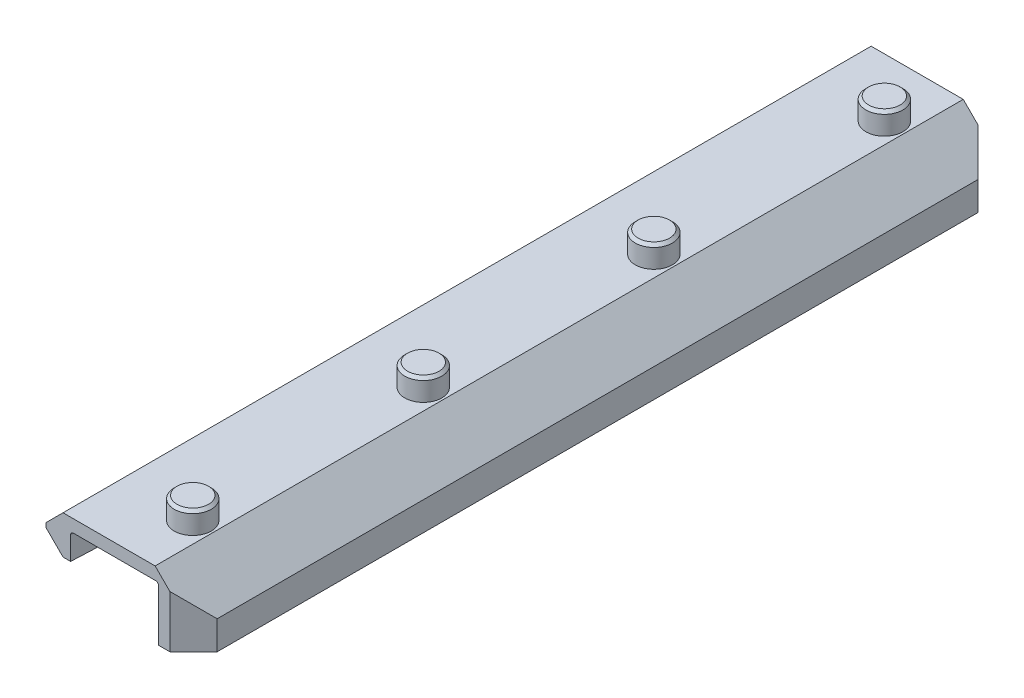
ISO-10303-21;
HEADER;
FILE_DESCRIPTION(('STEP AP214'),'2;1');
FILE_NAME('part.step','',(''),(''),'','','');
FILE_SCHEMA(('AUTOMOTIVE_DESIGN { 1 0 10303 214 1 1 1 1 }'));
ENDSEC;
DATA;
#1=APPLICATION_CONTEXT('core data for automotive mechanical design processes');
#2=APPLICATION_PROTOCOL_DEFINITION('international standard','automotive_design',2000,#1);
#3=PRODUCT_CONTEXT('',#1,'mechanical');
#4=PRODUCT('Part','Part','',(#3));
#5=PRODUCT_RELATED_PRODUCT_CATEGORY('part','',(#4));
#6=PRODUCT_DEFINITION_FORMATION('','',#4);
#7=PRODUCT_DEFINITION_CONTEXT('part definition',#1,'design');
#8=PRODUCT_DEFINITION('design','',#6,#7);
#9=PRODUCT_DEFINITION_SHAPE('','',#8);
#10=(LENGTH_UNIT() NAMED_UNIT(*) SI_UNIT(.MILLI.,.METRE.));
#11=(NAMED_UNIT(*) PLANE_ANGLE_UNIT() SI_UNIT($,.RADIAN.));
#12=(NAMED_UNIT(*) SI_UNIT($,.STERADIAN.) SOLID_ANGLE_UNIT());
#13=UNCERTAINTY_MEASURE_WITH_UNIT(LENGTH_MEASURE(1.E-05),#10,'distance_accuracy_value','');
#14=(GEOMETRIC_REPRESENTATION_CONTEXT(3) GLOBAL_UNCERTAINTY_ASSIGNED_CONTEXT((#13)) GLOBAL_UNIT_ASSIGNED_CONTEXT((#10,
#11,#12)) REPRESENTATION_CONTEXT('',''));
#15=CARTESIAN_POINT('',(0.,0.,0.));
#16=DIRECTION('',(0.,0.,1.));
#17=DIRECTION('',(1.,0.,0.));
#18=AXIS2_PLACEMENT_3D('',#15,#16,#17);
#19=CARTESIAN_POINT('',(-7.62,4.5,108.5342));
#20=DIRECTION('',(0.,-1.,0.));
#21=DIRECTION('',(0.,0.,-1.));
#22=AXIS2_PLACEMENT_3D('',#19,#20,#21);
#23=PLANE('',#22);
#24=CARTESIAN_POINT('',(1.98119999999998,4.5,69.7484));
#25=DIRECTION('',(0.,-1.,0.));
#26=DIRECTION('',(0.,0.,-1.));
#27=AXIS2_PLACEMENT_3D('',#24,#25,#26);
#28=CIRCLE('',#27,2.4892);
#29=CARTESIAN_POINT('',(1.98119999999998,4.5,67.2592));
#30=VERTEX_POINT('',#29);
#31=EDGE_CURVE('E257',#30,#30,#28,.F.);
#32=ORIENTED_EDGE('',*,*,#31,.F.);
#33=EDGE_LOOP('',(#32));
#34=FACE_BOUND('',#33,.T.);
#35=CARTESIAN_POINT('',(1.98119999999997,4.5,7.82319999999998));
#36=DIRECTION('',(0.,-1.,0.));
#37=DIRECTION('',(0.,0.,-1.));
#38=AXIS2_PLACEMENT_3D('',#35,#36,#37);
#39=CIRCLE('',#38,2.4892);
#40=CARTESIAN_POINT('',(1.98119999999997,4.5,5.33399999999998));
#41=VERTEX_POINT('',#40);
#42=EDGE_CURVE('E251',#41,#41,#39,.F.);
#43=ORIENTED_EDGE('',*,*,#42,.F.);
#44=EDGE_LOOP('',(#43));
#45=FACE_BOUND('',#44,.T.);
#46=DIRECTION('',(-1.,0.,0.));
#47=VECTOR('',#46,1.);
#48=CARTESIAN_POINT('',(-7.62,4.5,0.));
#49=LINE('',#48,#47);
#50=CARTESIAN_POINT('',(4.7498,4.5,0.));
#51=VERTEX_POINT('',#50);
#52=CARTESIAN_POINT('',(-7.62,4.5,0.));
#53=VERTEX_POINT('',#52);
#54=EDGE_CURVE('E362',#51,#53,#49,.T.);
#55=ORIENTED_EDGE('',*,*,#54,.T.);
#56=DIRECTION('',(0.,0.,-1.));
#57=VECTOR('',#56,1.);
#58=CARTESIAN_POINT('',(-7.62,4.5,108.5342));
#59=LINE('',#58,#57);
#60=CARTESIAN_POINT('',(-7.62,4.5,108.5342));
#61=VERTEX_POINT('',#60);
#62=EDGE_CURVE('E194',#61,#53,#59,.T.);
#63=ORIENTED_EDGE('',*,*,#62,.F.);
#64=DIRECTION('',(-1.,0.,0.));
#65=VECTOR('',#64,1.);
#66=CARTESIAN_POINT('',(-7.62,4.5,108.5342));
#67=LINE('',#66,#65);
#68=CARTESIAN_POINT('',(4.7498,4.5,108.5342));
#69=VERTEX_POINT('',#68);
#70=EDGE_CURVE('E181',#69,#61,#67,.T.);
#71=ORIENTED_EDGE('',*,*,#70,.F.);
#72=DIRECTION('',(0.,0.,-1.));
#73=VECTOR('',#72,1.);
#74=CARTESIAN_POINT('',(4.7498,4.5,108.5342));
#75=LINE('',#74,#73);
#76=EDGE_CURVE('E192',#69,#51,#75,.T.);
#77=ORIENTED_EDGE('',*,*,#76,.T.);
#78=EDGE_LOOP('',(#55,#63,#71,#77));
#79=FACE_BOUND('',#78,.T.);
#80=CARTESIAN_POINT('',(1.98119999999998,4.5,38.7858));
#81=DIRECTION('',(0.,-1.,0.));
#82=DIRECTION('',(0.,0.,-1.));
#83=AXIS2_PLACEMENT_3D('',#80,#81,#82);
#84=CIRCLE('',#83,2.4892);
#85=CARTESIAN_POINT('',(1.98119999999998,4.5,36.2966));
#86=VERTEX_POINT('',#85);
#87=EDGE_CURVE('E254',#86,#86,#84,.F.);
#88=ORIENTED_EDGE('',*,*,#87,.F.);
#89=EDGE_LOOP('',(#88));
#90=FACE_BOUND('',#89,.T.);
#91=CARTESIAN_POINT('',(1.98119999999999,4.5,100.711));
#92=DIRECTION('',(0.,-1.,0.));
#93=DIRECTION('',(0.,0.,-1.));
#94=AXIS2_PLACEMENT_3D('',#91,#92,#93);
#95=CIRCLE('',#94,2.4892);
#96=CARTESIAN_POINT('',(1.98119999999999,4.5,98.2218));
#97=VERTEX_POINT('',#96);
#98=EDGE_CURVE('E260',#97,#97,#95,.F.);
#99=ORIENTED_EDGE('',*,*,#98,.F.);
#100=EDGE_LOOP('',(#99));
#101=FACE_BOUND('',#100,.T.);
#102=ADVANCED_FACE('F33',(#34,#45,#79,#90,#101),#23,.F.);
#103=CARTESIAN_POINT('',(4.7498,4.5,108.5342));
#104=DIRECTION('',(-0.707106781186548,-0.707106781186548,0.));
#105=DIRECTION('',(0.707106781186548,-0.707106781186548,0.));
#106=AXIS2_PLACEMENT_3D('',#103,#104,#105);
#107=PLANE('',#106);
#108=DIRECTION('',(0.,0.,-1.));
#109=VECTOR('',#108,1.);
#110=CARTESIAN_POINT('',(9.906,-0.656200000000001,108.5342));
#111=LINE('',#110,#109);
#112=CARTESIAN_POINT('',(9.906,-0.656200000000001,105.3592));
#113=VERTEX_POINT('',#112);
#114=CARTESIAN_POINT('',(9.906,-0.656199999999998,3.175));
#115=VERTEX_POINT('',#114);
#116=EDGE_CURVE('E360',#113,#115,#111,.T.);
#117=ORIENTED_EDGE('',*,*,#116,.T.);
#118=DIRECTION('',(0.577350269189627,-0.577350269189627,0.577350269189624));
#119=VECTOR('',#118,1.);
#120=CARTESIAN_POINT('',(9.906,-0.656200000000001,3.17500000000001));
#121=LINE('',#120,#119);
#122=CARTESIAN_POINT('',(6.73099999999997,2.51880000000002,0.));
#123=VERTEX_POINT('',#122);
#124=EDGE_CURVE('E242',#115,#123,#121,.F.);
#125=ORIENTED_EDGE('',*,*,#124,.T.);
#126=DIRECTION('',(-0.707106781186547,0.707106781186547,0.));
#127=VECTOR('',#126,1.);
#128=CARTESIAN_POINT('',(4.7498,4.5,0.));
#129=LINE('',#128,#127);
#130=EDGE_CURVE('E201',#123,#51,#129,.T.);
#131=ORIENTED_EDGE('',*,*,#130,.T.);
#132=ORIENTED_EDGE('',*,*,#76,.F.);
#133=DIRECTION('',(-0.707106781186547,0.707106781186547,0.));
#134=VECTOR('',#133,1.);
#135=CARTESIAN_POINT('',(4.7498,4.5,108.5342));
#136=LINE('',#135,#134);
#137=CARTESIAN_POINT('',(6.73099999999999,2.5188,108.5342));
#138=VERTEX_POINT('',#137);
#139=EDGE_CURVE('E177',#138,#69,#136,.T.);
#140=ORIENTED_EDGE('',*,*,#139,.F.);
#141=DIRECTION('',(0.577350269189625,-0.577350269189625,-0.577350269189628));
#142=VECTOR('',#141,1.);
#143=CARTESIAN_POINT('',(4.00896666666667,5.24083333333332,111.256233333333));
#144=LINE('',#143,#142);
#145=EDGE_CURVE('E240',#138,#113,#144,.T.);
#146=ORIENTED_EDGE('',*,*,#145,.T.);
#147=EDGE_LOOP('',(#117,#125,#131,#132,#140,#146));
#148=FACE_BOUND('',#147,.T.);
#149=ADVANCED_FACE('F199',(#148),#107,.F.);
#150=CARTESIAN_POINT('',(-9.906,2.214,108.5342));
#151=DIRECTION('',(0.707106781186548,-0.707106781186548,0.));
#152=DIRECTION('',(0.707106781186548,0.707106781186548,0.));
#153=AXIS2_PLACEMENT_3D('',#150,#151,#152);
#154=PLANE('',#153);
#155=DIRECTION('',(-0.707106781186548,-0.707106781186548,0.));
#156=VECTOR('',#155,1.);
#157=CARTESIAN_POINT('',(-9.906,2.214,0.));
#158=LINE('',#157,#156);
#159=CARTESIAN_POINT('',(-9.906,2.214,0.));
#160=VERTEX_POINT('',#159);
#161=EDGE_CURVE('E364',#53,#160,#158,.T.);
#162=ORIENTED_EDGE('',*,*,#161,.T.);
#163=DIRECTION('',(0.,0.,-1.));
#164=VECTOR('',#163,1.);
#165=CARTESIAN_POINT('',(-9.906,2.214,108.5342));
#166=LINE('',#165,#164);
#167=CARTESIAN_POINT('',(-9.906,2.214,108.5342));
#168=VERTEX_POINT('',#167);
#169=EDGE_CURVE('E208',#168,#160,#166,.T.);
#170=ORIENTED_EDGE('',*,*,#169,.F.);
#171=DIRECTION('',(-0.707106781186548,-0.707106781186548,0.));
#172=VECTOR('',#171,1.);
#173=CARTESIAN_POINT('',(-9.906,2.214,108.5342));
#174=LINE('',#173,#172);
#175=EDGE_CURVE('E196',#61,#168,#174,.T.);
#176=ORIENTED_EDGE('',*,*,#175,.F.);
#177=ORIENTED_EDGE('',*,*,#62,.T.);
#178=EDGE_LOOP('',(#162,#170,#176,#177));
#179=FACE_BOUND('',#178,.T.);
#180=ADVANCED_FACE('F433',(#179),#154,.F.);
#181=CARTESIAN_POINT('',(-9.906,1.6298,108.5342));
#182=DIRECTION('',(1.,0.,0.));
#183=DIRECTION('',(0.,0.,-1.));
#184=AXIS2_PLACEMENT_3D('',#181,#182,#183);
#185=PLANE('',#184);
#186=DIRECTION('',(0.,-1.,0.));
#187=VECTOR('',#186,1.);
#188=CARTESIAN_POINT('',(-9.906,1.6298,0.));
#189=LINE('',#188,#187);
#190=CARTESIAN_POINT('',(-9.906,1.6298,0.));
#191=VERTEX_POINT('',#190);
#192=EDGE_CURVE('E366',#160,#191,#189,.T.);
#193=ORIENTED_EDGE('',*,*,#192,.T.);
#194=DIRECTION('',(0.,0.,-1.));
#195=VECTOR('',#194,1.);
#196=CARTESIAN_POINT('',(-9.906,1.6298,108.5342));
#197=LINE('',#196,#195);
#198=CARTESIAN_POINT('',(-9.906,1.6298,108.5342));
#199=VERTEX_POINT('',#198);
#200=EDGE_CURVE('E390',#199,#191,#197,.T.);
#201=ORIENTED_EDGE('',*,*,#200,.F.);
#202=DIRECTION('',(0.,-1.,0.));
#203=VECTOR('',#202,1.);
#204=CARTESIAN_POINT('',(-9.906,1.6298,108.5342));
#205=LINE('',#204,#203);
#206=EDGE_CURVE('E355',#168,#199,#205,.T.);
#207=ORIENTED_EDGE('',*,*,#206,.F.);
#208=ORIENTED_EDGE('',*,*,#169,.T.);
#209=EDGE_LOOP('',(#193,#201,#207,#208));
#210=FACE_BOUND('',#209,.T.);
#211=ADVANCED_FACE('F397',(#210),#185,.F.);
#212=CARTESIAN_POINT('',(-7.62,-0.656200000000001,108.5342));
#213=DIRECTION('',(0.707106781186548,0.707106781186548,0.));
#214=DIRECTION('',(-0.707106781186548,0.707106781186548,0.));
#215=AXIS2_PLACEMENT_3D('',#212,#213,#214);
#216=PLANE('',#215);
#217=DIRECTION('',(0.707106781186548,-0.707106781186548,0.));
#218=VECTOR('',#217,1.);
#219=CARTESIAN_POINT('',(-7.62,-0.656200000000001,0.));
#220=LINE('',#219,#218);
#221=CARTESIAN_POINT('',(-7.62,-0.656200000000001,0.));
#222=VERTEX_POINT('',#221);
#223=EDGE_CURVE('E368',#191,#222,#220,.T.);
#224=ORIENTED_EDGE('',*,*,#223,.T.);
#225=DIRECTION('',(0.,0.,-1.));
#226=VECTOR('',#225,1.);
#227=CARTESIAN_POINT('',(-7.62,-0.656200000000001,108.5342));
#228=LINE('',#227,#226);
#229=CARTESIAN_POINT('',(-7.62,-0.656200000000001,108.5342));
#230=VERTEX_POINT('',#229);
#231=EDGE_CURVE('E388',#230,#222,#228,.T.);
#232=ORIENTED_EDGE('',*,*,#231,.F.);
#233=DIRECTION('',(0.707106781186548,-0.707106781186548,0.));
#234=VECTOR('',#233,1.);
#235=CARTESIAN_POINT('',(-7.62,-0.656200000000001,108.5342));
#236=LINE('',#235,#234);
#237=EDGE_CURVE('E347',#199,#230,#236,.T.);
#238=ORIENTED_EDGE('',*,*,#237,.F.);
#239=ORIENTED_EDGE('',*,*,#200,.T.);
#240=EDGE_LOOP('',(#224,#232,#238,#239));
#241=FACE_BOUND('',#240,.T.);
#242=ADVANCED_FACE('F406',(#241),#216,.F.);
#243=CARTESIAN_POINT('',(-6.096,-0.656200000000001,108.5342));
#244=DIRECTION('',(0.,1.,0.));
#245=DIRECTION('',(-1.,0.,0.));
#246=AXIS2_PLACEMENT_3D('',#243,#244,#245);
#247=PLANE('',#246);
#248=DIRECTION('',(1.,0.,0.));
#249=VECTOR('',#248,1.);
#250=CARTESIAN_POINT('',(-6.096,-0.656200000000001,0.));
#251=LINE('',#250,#249);
#252=CARTESIAN_POINT('',(-6.604,-0.656200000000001,0.));
#253=VERTEX_POINT('',#252);
#254=EDGE_CURVE('E370',#222,#253,#251,.T.);
#255=ORIENTED_EDGE('',*,*,#254,.T.);
#256=DIRECTION('',(-0.0457187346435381,0.,-0.998954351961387));
#257=VECTOR('',#256,1.);
#258=CARTESIAN_POINT('',(-6.096,-0.656200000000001,11.0998000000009));
#259=LINE('',#258,#257);
#260=CARTESIAN_POINT('',(-6.09599999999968,-0.656200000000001,11.0998000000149));
#261=VERTEX_POINT('',#260);
#262=EDGE_CURVE('E233',#253,#261,#259,.F.);
#263=ORIENTED_EDGE('',*,*,#262,.T.);
#264=DIRECTION('',(0.,0.,-1.));
#265=VECTOR('',#264,1.);
#266=CARTESIAN_POINT('',(-6.096,-0.656200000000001,108.5342));
#267=LINE('',#266,#265);
#268=CARTESIAN_POINT('',(-6.096,-0.656200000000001,97.4343999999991));
#269=VERTEX_POINT('',#268);
#270=EDGE_CURVE('E385',#269,#261,#267,.T.);
#271=ORIENTED_EDGE('',*,*,#270,.F.);
#272=DIRECTION('',(-0.0457187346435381,0.,0.998954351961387));
#273=VECTOR('',#272,1.);
#274=CARTESIAN_POINT('',(-6.604,-0.656200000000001,108.5342));
#275=LINE('',#274,#273);
#276=CARTESIAN_POINT('',(-6.604,-0.656200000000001,108.5342));
#277=VERTEX_POINT('',#276);
#278=EDGE_CURVE('E219',#269,#277,#275,.T.);
#279=ORIENTED_EDGE('',*,*,#278,.T.);
#280=DIRECTION('',(1.,0.,0.));
#281=VECTOR('',#280,1.);
#282=CARTESIAN_POINT('',(-6.096,-0.656200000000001,108.5342));
#283=LINE('',#282,#281);
#284=EDGE_CURVE('E345',#230,#277,#283,.T.);
#285=ORIENTED_EDGE('',*,*,#284,.F.);
#286=ORIENTED_EDGE('',*,*,#231,.T.);
#287=EDGE_LOOP('',(#255,#263,#271,#279,#285,#286));
#288=FACE_BOUND('',#287,.T.);
#289=ADVANCED_FACE('F407',(#288),#247,.F.);
#290=CARTESIAN_POINT('',(-6.096,2.8236,108.5342));
#291=DIRECTION('',(-1.,0.,0.));
#292=DIRECTION('',(0.,-1.,0.));
#293=AXIS2_PLACEMENT_3D('',#290,#291,#292);
#294=PLANE('',#293);
#295=DIRECTION('',(0.,1.,0.));
#296=VECTOR('',#295,1.);
#297=CARTESIAN_POINT('',(-6.096,2.8236,11.0998000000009));
#298=LINE('',#297,#296);
#299=CARTESIAN_POINT('',(-6.096,2.4426,11.0998000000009));
#300=VERTEX_POINT('',#299);
#301=EDGE_CURVE('E230',#261,#300,#298,.T.);
#302=ORIENTED_EDGE('',*,*,#301,.T.);
#303=DIRECTION('',(0.,0.,-1.));
#304=VECTOR('',#303,1.);
#305=CARTESIAN_POINT('',(-6.096,2.4426,97.4343999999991));
#306=LINE('',#305,#304);
#307=CARTESIAN_POINT('',(-6.096,2.4426,97.4343999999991));
#308=VERTEX_POINT('',#307);
#309=EDGE_CURVE('E310',#300,#308,#306,.F.);
#310=ORIENTED_EDGE('',*,*,#309,.T.);
#311=DIRECTION('',(0.,-1.,0.));
#312=VECTOR('',#311,1.);
#313=CARTESIAN_POINT('',(-6.096,-0.656200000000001,97.4343999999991));
#314=LINE('',#313,#312);
#315=EDGE_CURVE('E217',#308,#269,#314,.T.);
#316=ORIENTED_EDGE('',*,*,#315,.T.);
#317=ORIENTED_EDGE('',*,*,#270,.T.);
#318=EDGE_LOOP('',(#302,#310,#316,#317));
#319=FACE_BOUND('',#318,.T.);
#320=ADVANCED_FACE('F415',(#319),#294,.F.);
#321=CARTESIAN_POINT('',(4.699,2.8236,108.5342));
#322=DIRECTION('',(0.,1.,0.));
#323=DIRECTION('',(-1.,0.,0.));
#324=AXIS2_PLACEMENT_3D('',#321,#322,#323);
#325=PLANE('',#324);
#326=DIRECTION('',(1.,0.,0.));
#327=VECTOR('',#326,1.);
#328=CARTESIAN_POINT('',(4.699,2.8236,0.));
#329=LINE('',#328,#327);
#330=CARTESIAN_POINT('',(-6.22260119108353,2.8236,0.));
#331=VERTEX_POINT('',#330);
#332=CARTESIAN_POINT('',(4.82560119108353,2.8236,0.));
#333=VERTEX_POINT('',#332);
#334=EDGE_CURVE('E373',#331,#333,#329,.T.);
#335=ORIENTED_EDGE('',*,*,#334,.T.);
#336=DIRECTION('',(0.0457187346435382,0.,-0.998954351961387));
#337=VECTOR('',#336,1.);
#338=CARTESIAN_POINT('',(-0.131521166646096,2.8236,108.313123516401));
#339=LINE('',#338,#337);
#340=CARTESIAN_POINT('',(4.318,2.8236,11.0910860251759));
#341=VERTEX_POINT('',#340);
#342=EDGE_CURVE('E298',#333,#341,#339,.F.);
#343=ORIENTED_EDGE('',*,*,#342,.T.);
#344=DIRECTION('',(0.,0.,-1.));
#345=VECTOR('',#344,1.);
#346=CARTESIAN_POINT('',(4.318,2.8236,97.4343999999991));
#347=LINE('',#346,#345);
#348=CARTESIAN_POINT('',(4.318,2.8236,97.4431139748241));
#349=VERTEX_POINT('',#348);
#350=EDGE_CURVE('E294',#341,#349,#347,.F.);
#351=ORIENTED_EDGE('',*,*,#350,.T.);
#352=DIRECTION('',(0.0457187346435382,0.,0.998954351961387));
#353=VECTOR('',#352,1.);
#354=CARTESIAN_POINT('',(4.82533656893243,2.8236,108.528418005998));
#355=LINE('',#354,#353);
#356=CARTESIAN_POINT('',(4.82560119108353,2.8236,108.5342));
#357=VERTEX_POINT('',#356);
#358=EDGE_CURVE('E296',#349,#357,#355,.T.);
#359=ORIENTED_EDGE('',*,*,#358,.T.);
#360=DIRECTION('',(1.,0.,0.));
#361=VECTOR('',#360,1.);
#362=CARTESIAN_POINT('',(4.699,2.8236,108.5342));
#363=LINE('',#362,#361);
#364=CARTESIAN_POINT('',(-6.22260119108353,2.8236,108.5342));
#365=VERTEX_POINT('',#364);
#366=EDGE_CURVE('E351',#365,#357,#363,.T.);
#367=ORIENTED_EDGE('',*,*,#366,.F.);
#368=DIRECTION('',(0.0457187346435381,0.,-0.998954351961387));
#369=VECTOR('',#368,1.);
#370=CARTESIAN_POINT('',(-6.19977283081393,2.8236,108.035400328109));
#371=LINE('',#370,#369);
#372=CARTESIAN_POINT('',(-5.715,2.8236,97.4431139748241));
#373=VERTEX_POINT('',#372);
#374=EDGE_CURVE('E289',#365,#373,#371,.T.);
#375=ORIENTED_EDGE('',*,*,#374,.T.);
#376=DIRECTION('',(0.,0.,-1.));
#377=VECTOR('',#376,1.);
#378=CARTESIAN_POINT('',(-5.715,2.8236,11.0998000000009));
#379=LINE('',#378,#377);
#380=CARTESIAN_POINT('',(-5.715,2.8236,11.0910860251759));
#381=VERTEX_POINT('',#380);
#382=EDGE_CURVE('E287',#373,#381,#379,.T.);
#383=ORIENTED_EDGE('',*,*,#382,.T.);
#384=DIRECTION('',(0.0457187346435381,0.,0.998954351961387));
#385=VECTOR('',#384,1.);
#386=CARTESIAN_POINT('',(-1.24291509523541,2.8236,108.80614119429));
#387=LINE('',#386,#385);
#388=EDGE_CURVE('E291',#381,#331,#387,.F.);
#389=ORIENTED_EDGE('',*,*,#388,.T.);
#390=EDGE_LOOP('',(#335,#343,#351,#359,#367,#375,#383,#389));
#391=FACE_BOUND('',#390,.T.);
#392=ADVANCED_FACE('F417',(#391),#325,.F.);
#393=CARTESIAN_POINT('',(4.699,-4.5,108.5342));
#394=DIRECTION('',(1.,0.,0.));
#395=DIRECTION('',(0.,1.,0.));
#396=AXIS2_PLACEMENT_3D('',#393,#394,#395);
#397=PLANE('',#396);
#398=DIRECTION('',(0.,1.,0.));
#399=VECTOR('',#398,1.);
#400=CARTESIAN_POINT('',(4.699,2.8236,97.4343999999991));
#401=LINE('',#400,#399);
#402=CARTESIAN_POINT('',(4.699,-4.5,97.4343999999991));
#403=VERTEX_POINT('',#402);
#404=CARTESIAN_POINT('',(4.699,2.4426,97.4343999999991));
#405=VERTEX_POINT('',#404);
#406=EDGE_CURVE('E215',#403,#405,#401,.T.);
#407=ORIENTED_EDGE('',*,*,#406,.T.);
#408=DIRECTION('',(0.,0.,-1.));
#409=VECTOR('',#408,1.);
#410=CARTESIAN_POINT('',(4.699,2.4426,11.0998000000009));
#411=LINE('',#410,#409);
#412=CARTESIAN_POINT('',(4.699,2.4426,11.0998000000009));
#413=VERTEX_POINT('',#412);
#414=EDGE_CURVE('E308',#405,#413,#411,.T.);
#415=ORIENTED_EDGE('',*,*,#414,.T.);
#416=DIRECTION('',(0.,-1.,0.));
#417=VECTOR('',#416,1.);
#418=CARTESIAN_POINT('',(4.699,-4.5,11.0998000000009));
#419=LINE('',#418,#417);
#420=CARTESIAN_POINT('',(4.69899999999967,-4.5,11.0998000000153));
#421=VERTEX_POINT('',#420);
#422=EDGE_CURVE('E221',#413,#421,#419,.T.);
#423=ORIENTED_EDGE('',*,*,#422,.T.);
#424=DIRECTION('',(0.,0.,-1.));
#425=VECTOR('',#424,1.);
#426=CARTESIAN_POINT('',(4.699,-4.5,108.5342));
#427=LINE('',#426,#425);
#428=EDGE_CURVE('E382',#403,#421,#427,.T.);
#429=ORIENTED_EDGE('',*,*,#428,.F.);
#430=EDGE_LOOP('',(#407,#415,#423,#429));
#431=FACE_BOUND('',#430,.T.);
#432=ADVANCED_FACE('F423',(#431),#397,.F.);
#433=CARTESIAN_POINT('',(9.906,-4.5,108.5342));
#434=DIRECTION('',(0.,1.,0.));
#435=DIRECTION('',(0.,0.,1.));
#436=AXIS2_PLACEMENT_3D('',#433,#434,#435);
#437=PLANE('',#436);
#438=DIRECTION('',(1.,0.,0.));
#439=VECTOR('',#438,1.);
#440=CARTESIAN_POINT('',(9.906,-4.5,0.));
#441=LINE('',#440,#439);
#442=CARTESIAN_POINT('',(5.207,-4.5,0.));
#443=VERTEX_POINT('',#442);
#444=CARTESIAN_POINT('',(6.73099999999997,-4.5,0.));
#445=VERTEX_POINT('',#444);
#446=EDGE_CURVE('E187',#443,#445,#441,.T.);
#447=ORIENTED_EDGE('',*,*,#446,.T.);
#448=DIRECTION('',(-0.707106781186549,0.,-0.707106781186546));
#449=VECTOR('',#448,1.);
#450=CARTESIAN_POINT('',(9.906,-4.5,3.17500000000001));
#451=LINE('',#450,#449);
#452=CARTESIAN_POINT('',(9.906,-4.5,3.17500000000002));
#453=VERTEX_POINT('',#452);
#454=EDGE_CURVE('E248',#445,#453,#451,.F.);
#455=ORIENTED_EDGE('',*,*,#454,.T.);
#456=DIRECTION('',(0.,0.,-1.));
#457=VECTOR('',#456,1.);
#458=CARTESIAN_POINT('',(9.906,-4.5,108.5342));
#459=LINE('',#458,#457);
#460=CARTESIAN_POINT('',(9.906,-4.5,105.3592));
#461=VERTEX_POINT('',#460);
#462=EDGE_CURVE('E379',#461,#453,#459,.T.);
#463=ORIENTED_EDGE('',*,*,#462,.F.);
#464=DIRECTION('',(-0.707106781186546,0.,0.707106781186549));
#465=VECTOR('',#464,1.);
#466=CARTESIAN_POINT('',(6.731,-4.5,108.5342));
#467=LINE('',#466,#465);
#468=CARTESIAN_POINT('',(6.731,-4.5,108.5342));
#469=VERTEX_POINT('',#468);
#470=EDGE_CURVE('E246',#461,#469,#467,.T.);
#471=ORIENTED_EDGE('',*,*,#470,.T.);
#472=DIRECTION('',(1.,0.,0.));
#473=VECTOR('',#472,1.);
#474=CARTESIAN_POINT('',(9.906,-4.5,108.5342));
#475=LINE('',#474,#473);
#476=CARTESIAN_POINT('',(5.207,-4.5,108.5342));
#477=VERTEX_POINT('',#476);
#478=EDGE_CURVE('E353',#477,#469,#475,.T.);
#479=ORIENTED_EDGE('',*,*,#478,.F.);
#480=DIRECTION('',(-0.0457187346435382,0.,-0.998954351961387));
#481=VECTOR('',#480,1.);
#482=CARTESIAN_POINT('',(5.207,-4.5,108.5342));
#483=LINE('',#482,#481);
#484=EDGE_CURVE('E213',#477,#403,#483,.T.);
#485=ORIENTED_EDGE('',*,*,#484,.T.);
#486=ORIENTED_EDGE('',*,*,#428,.T.);
#487=DIRECTION('',(-0.0457187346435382,0.,0.998954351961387));
#488=VECTOR('',#487,1.);
#489=CARTESIAN_POINT('',(4.699,-4.5,11.0998000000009));
#490=LINE('',#489,#488);
#491=EDGE_CURVE('E223',#421,#443,#490,.F.);
#492=ORIENTED_EDGE('',*,*,#491,.T.);
#493=EDGE_LOOP('',(#447,#455,#463,#471,#479,#485,#486,#492));
#494=FACE_BOUND('',#493,.T.);
#495=ADVANCED_FACE('F631',(#494),#437,.F.);
#496=CARTESIAN_POINT('',(9.906,-0.656200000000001,108.5342));
#497=DIRECTION('',(-1.,0.,0.));
#498=DIRECTION('',(0.,0.,1.));
#499=AXIS2_PLACEMENT_3D('',#496,#497,#498);
#500=PLANE('',#499);
#501=ORIENTED_EDGE('',*,*,#462,.T.);
#502=DIRECTION('',(0.,1.,0.));
#503=VECTOR('',#502,1.);
#504=CARTESIAN_POINT('',(9.906,-0.656200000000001,3.17500000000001));
#505=LINE('',#504,#503);
#506=EDGE_CURVE('E237',#453,#115,#505,.T.);
#507=ORIENTED_EDGE('',*,*,#506,.T.);
#508=ORIENTED_EDGE('',*,*,#116,.F.);
#509=DIRECTION('',(0.,-1.,0.));
#510=VECTOR('',#509,1.);
#511=CARTESIAN_POINT('',(9.906,-4.5,105.3592));
#512=LINE('',#511,#510);
#513=EDGE_CURVE('E235',#113,#461,#512,.T.);
#514=ORIENTED_EDGE('',*,*,#513,.T.);
#515=EDGE_LOOP('',(#501,#507,#508,#514));
#516=FACE_BOUND('',#515,.T.);
#517=ADVANCED_FACE('F624',(#516),#500,.F.);
#518=CARTESIAN_POINT('',(-1.4351,10.6849,108.5342));
#519=DIRECTION('',(0.,0.,1.));
#520=DIRECTION('',(1.,0.,0.));
#521=AXIS2_PLACEMENT_3D('',#518,#519,#520);
#522=PLANE('',#521);
#523=ORIENTED_EDGE('',*,*,#478,.T.);
#524=DIRECTION('',(0.,1.,0.));
#525=VECTOR('',#524,1.);
#526=CARTESIAN_POINT('',(6.731,-0.656200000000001,108.5342));
#527=LINE('',#526,#525);
#528=EDGE_CURVE('E184',#469,#138,#527,.T.);
#529=ORIENTED_EDGE('',*,*,#528,.T.);
#530=ORIENTED_EDGE('',*,*,#139,.T.);
#531=ORIENTED_EDGE('',*,*,#70,.T.);
#532=ORIENTED_EDGE('',*,*,#175,.T.);
#533=ORIENTED_EDGE('',*,*,#206,.T.);
#534=ORIENTED_EDGE('',*,*,#237,.T.);
#535=ORIENTED_EDGE('',*,*,#284,.T.);
#536=DIRECTION('',(0.,1.,0.));
#537=VECTOR('',#536,1.);
#538=CARTESIAN_POINT('',(-6.604,2.8236,108.5342));
#539=LINE('',#538,#537);
#540=CARTESIAN_POINT('',(-6.604,2.4426,108.5342));
#541=VERTEX_POINT('',#540);
#542=EDGE_CURVE('E203',#277,#541,#539,.T.);
#543=ORIENTED_EDGE('',*,*,#542,.T.);
#544=CARTESIAN_POINT('',(-6.22260119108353,2.4426,108.5342));
#545=DIRECTION('',(0.,0.,1.));
#546=DIRECTION('',(1.,0.,0.));
#547=AXIS2_PLACEMENT_3D('',#544,#545,#546);
#548=ELLIPSE('',#547,0.381398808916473,0.381);
#549=EDGE_CURVE('E42',#541,#365,#548,.F.);
#550=ORIENTED_EDGE('',*,*,#549,.T.);
#551=ORIENTED_EDGE('',*,*,#366,.T.);
#552=CARTESIAN_POINT('',(4.82560119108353,2.4426,108.5342));
#553=DIRECTION('',(0.,0.,1.));
#554=DIRECTION('',(1.,0.,0.));
#555=AXIS2_PLACEMENT_3D('',#552,#553,#554);
#556=ELLIPSE('',#555,0.381398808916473,0.381);
#557=CARTESIAN_POINT('',(5.207,2.4426,108.5342));
#558=VERTEX_POINT('',#557);
#559=EDGE_CURVE('E11',#357,#558,#556,.F.);
#560=ORIENTED_EDGE('',*,*,#559,.T.);
#561=DIRECTION('',(0.,-1.,0.));
#562=VECTOR('',#561,1.);
#563=CARTESIAN_POINT('',(5.207,-4.5,108.5342));
#564=LINE('',#563,#562);
#565=EDGE_CURVE('E206',#558,#477,#564,.T.);
#566=ORIENTED_EDGE('',*,*,#565,.T.);
#567=EDGE_LOOP('',(#523,#529,#530,#531,#532,#533,#534,#535,#543,#550,#551,#560,#566));
#568=FACE_BOUND('',#567,.T.);
#569=ADVANCED_FACE('F180',(#568),#522,.T.);
#570=CARTESIAN_POINT('',(-1.4351,10.6849,0.));
#571=DIRECTION('',(0.,0.,1.));
#572=DIRECTION('',(1.,0.,0.));
#573=AXIS2_PLACEMENT_3D('',#570,#571,#572);
#574=PLANE('',#573);
#575=ORIENTED_EDGE('',*,*,#130,.F.);
#576=DIRECTION('',(0.,-1.,0.));
#577=VECTOR('',#576,1.);
#578=CARTESIAN_POINT('',(6.73099999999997,10.6849,0.));
#579=LINE('',#578,#577);
#580=EDGE_CURVE('E244',#123,#445,#579,.T.);
#581=ORIENTED_EDGE('',*,*,#580,.T.);
#582=ORIENTED_EDGE('',*,*,#446,.F.);
#583=DIRECTION('',(0.,1.,0.));
#584=VECTOR('',#583,1.);
#585=CARTESIAN_POINT('',(5.207,10.6849,0.));
#586=LINE('',#585,#584);
#587=CARTESIAN_POINT('',(5.207,2.4426,0.));
#588=VERTEX_POINT('',#587);
#589=EDGE_CURVE('E227',#443,#588,#586,.T.);
#590=ORIENTED_EDGE('',*,*,#589,.T.);
#591=CARTESIAN_POINT('',(4.82560119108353,2.4426,0.));
#592=DIRECTION('',(0.,0.,1.));
#593=DIRECTION('',(1.,0.,0.));
#594=AXIS2_PLACEMENT_3D('',#591,#592,#593);
#595=ELLIPSE('',#594,0.381398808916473,0.381);
#596=EDGE_CURVE('E312',#588,#333,#595,.T.);
#597=ORIENTED_EDGE('',*,*,#596,.T.);
#598=ORIENTED_EDGE('',*,*,#334,.F.);
#599=CARTESIAN_POINT('',(-6.22260119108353,2.4426,0.));
#600=DIRECTION('',(0.,0.,1.));
#601=DIRECTION('',(1.,0.,0.));
#602=AXIS2_PLACEMENT_3D('',#599,#600,#601);
#603=ELLIPSE('',#602,0.381398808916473,0.381);
#604=CARTESIAN_POINT('',(-6.604,2.4426,0.));
#605=VERTEX_POINT('',#604);
#606=EDGE_CURVE('E314',#331,#605,#603,.T.);
#607=ORIENTED_EDGE('',*,*,#606,.T.);
#608=DIRECTION('',(0.,-1.,0.));
#609=VECTOR('',#608,1.);
#610=CARTESIAN_POINT('',(-6.604,10.6849,0.));
#611=LINE('',#610,#609);
#612=EDGE_CURVE('E225',#605,#253,#611,.T.);
#613=ORIENTED_EDGE('',*,*,#612,.T.);
#614=ORIENTED_EDGE('',*,*,#254,.F.);
#615=ORIENTED_EDGE('',*,*,#223,.F.);
#616=ORIENTED_EDGE('',*,*,#192,.F.);
#617=ORIENTED_EDGE('',*,*,#161,.F.);
#618=ORIENTED_EDGE('',*,*,#54,.F.);
#619=EDGE_LOOP('',(#575,#581,#582,#590,#597,#598,#607,#613,#614,#615,#616,#617,#618));
#620=FACE_BOUND('',#619,.T.);
#621=ADVANCED_FACE('F403',(#620),#574,.F.);
#622=CARTESIAN_POINT('',(5.207,10.6849,108.5342));
#623=DIRECTION('',(-0.998954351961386,0.,0.0457187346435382));
#624=DIRECTION('',(0.0457187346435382,0.,0.998954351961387));
#625=AXIS2_PLACEMENT_3D('',#622,#623,#624);
#626=PLANE('',#625);
#627=ORIENTED_EDGE('',*,*,#565,.F.);
#628=DIRECTION('',(0.0457187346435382,0.,0.998954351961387));
#629=VECTOR('',#628,1.);
#630=CARTESIAN_POINT('',(5.207,2.4426,108.5342));
#631=LINE('',#630,#629);
#632=EDGE_CURVE('E55',#558,#405,#631,.F.);
#633=ORIENTED_EDGE('',*,*,#632,.T.);
#634=ORIENTED_EDGE('',*,*,#406,.F.);
#635=ORIENTED_EDGE('',*,*,#484,.F.);
#636=EDGE_LOOP('',(#627,#633,#634,#635));
#637=FACE_BOUND('',#636,.T.);
#638=ADVANCED_FACE('F440',(#637),#626,.T.);
#639=CARTESIAN_POINT('',(-6.604,10.6849,108.5342));
#640=DIRECTION('',(0.998954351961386,0.,0.0457187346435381));
#641=DIRECTION('',(0.0457187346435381,0.,-0.998954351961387));
#642=AXIS2_PLACEMENT_3D('',#639,#640,#641);
#643=PLANE('',#642);
#644=ORIENTED_EDGE('',*,*,#315,.F.);
#645=DIRECTION('',(0.0457187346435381,0.,-0.998954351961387));
#646=VECTOR('',#645,1.);
#647=CARTESIAN_POINT('',(-6.604,2.4426,108.5342));
#648=LINE('',#647,#646);
#649=EDGE_CURVE('E305',#308,#541,#648,.F.);
#650=ORIENTED_EDGE('',*,*,#649,.T.);
#651=ORIENTED_EDGE('',*,*,#542,.F.);
#652=ORIENTED_EDGE('',*,*,#278,.F.);
#653=EDGE_LOOP('',(#644,#650,#651,#652));
#654=FACE_BOUND('',#653,.T.);
#655=ADVANCED_FACE('F340',(#654),#643,.T.);
#656=CARTESIAN_POINT('',(4.699,-4.5,11.0998000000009));
#657=DIRECTION('',(0.998954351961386,0.,0.0457187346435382));
#658=DIRECTION('',(0.0457187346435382,0.,-0.998954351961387));
#659=AXIS2_PLACEMENT_3D('',#656,#657,#658);
#660=PLANE('',#659);
#661=ORIENTED_EDGE('',*,*,#422,.F.);
#662=DIRECTION('',(-0.0457187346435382,0.,0.998954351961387));
#663=VECTOR('',#662,1.);
#664=CARTESIAN_POINT('',(4.699,2.4426,11.0998000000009));
#665=LINE('',#664,#663);
#666=EDGE_CURVE('E301',#413,#588,#665,.F.);
#667=ORIENTED_EDGE('',*,*,#666,.T.);
#668=ORIENTED_EDGE('',*,*,#589,.F.);
#669=ORIENTED_EDGE('',*,*,#491,.F.);
#670=EDGE_LOOP('',(#661,#667,#668,#669));
#671=FACE_BOUND('',#670,.T.);
#672=ADVANCED_FACE('F445',(#671),#660,.F.);
#673=CARTESIAN_POINT('',(-6.096,2.8236,11.0998000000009));
#674=DIRECTION('',(-0.998954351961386,0.,0.0457187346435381));
#675=DIRECTION('',(0.0457187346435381,0.,0.998954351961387));
#676=AXIS2_PLACEMENT_3D('',#673,#674,#675);
#677=PLANE('',#676);
#678=ORIENTED_EDGE('',*,*,#612,.F.);
#679=DIRECTION('',(-0.0457187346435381,0.,-0.998954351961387));
#680=VECTOR('',#679,1.);
#681=CARTESIAN_POINT('',(-6.096,2.4426,11.0998000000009));
#682=LINE('',#681,#680);
#683=EDGE_CURVE('E303',#605,#300,#682,.F.);
#684=ORIENTED_EDGE('',*,*,#683,.T.);
#685=ORIENTED_EDGE('',*,*,#301,.F.);
#686=ORIENTED_EDGE('',*,*,#262,.F.);
#687=EDGE_LOOP('',(#678,#684,#685,#686));
#688=FACE_BOUND('',#687,.T.);
#689=ADVANCED_FACE('F413',(#688),#677,.F.);
#690=CARTESIAN_POINT('',(9.906,-0.656200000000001,3.17500000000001));
#691=DIRECTION('',(-0.707106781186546,0.,0.707106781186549));
#692=DIRECTION('',(0.707106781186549,0.,0.707106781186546));
#693=AXIS2_PLACEMENT_3D('',#690,#691,#692);
#694=PLANE('',#693);
#695=ORIENTED_EDGE('',*,*,#454,.F.);
#696=ORIENTED_EDGE('',*,*,#580,.F.);
#697=ORIENTED_EDGE('',*,*,#124,.F.);
#698=ORIENTED_EDGE('',*,*,#506,.F.);
#699=EDGE_LOOP('',(#695,#696,#697,#698));
#700=FACE_BOUND('',#699,.T.);
#701=ADVANCED_FACE('F451',(#700),#694,.F.);
#702=CARTESIAN_POINT('',(6.731,10.6849,108.5342));
#703=DIRECTION('',(0.707106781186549,0.,0.707106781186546));
#704=DIRECTION('',(0.707106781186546,0.,-0.707106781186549));
#705=AXIS2_PLACEMENT_3D('',#702,#703,#704);
#706=PLANE('',#705);
#707=ORIENTED_EDGE('',*,*,#470,.F.);
#708=ORIENTED_EDGE('',*,*,#513,.F.);
#709=ORIENTED_EDGE('',*,*,#145,.F.);
#710=ORIENTED_EDGE('',*,*,#528,.F.);
#711=EDGE_LOOP('',(#707,#708,#709,#710));
#712=FACE_BOUND('',#711,.T.);
#713=ADVANCED_FACE('F454',(#712),#706,.T.);
#714=CARTESIAN_POINT('',(1.98119999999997,7.421,7.82319999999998));
#715=DIRECTION('',(0.,-1.,0.));
#716=DIRECTION('',(0.,0.,-1.));
#717=AXIS2_PLACEMENT_3D('',#714,#715,#716);
#718=CYLINDRICAL_SURFACE('',#717,2.4892);
#719=CARTESIAN_POINT('',(1.98119999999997,7.04,7.82319999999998));
#720=DIRECTION('',(0.,1.,0.));
#721=DIRECTION('',(0.,0.,1.));
#722=AXIS2_PLACEMENT_3D('',#719,#720,#721);
#723=CIRCLE('',#722,2.4892);
#724=CARTESIAN_POINT('',(1.98119999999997,7.04,10.3124));
#725=VERTEX_POINT('',#724);
#726=EDGE_CURVE('E284',#725,#725,#723,.F.);
#727=ORIENTED_EDGE('',*,*,#726,.T.);
#728=EDGE_LOOP('',(#727));
#729=FACE_BOUND('',#728,.T.);
#730=ORIENTED_EDGE('',*,*,#42,.T.);
#731=EDGE_LOOP('',(#730));
#732=FACE_BOUND('',#731,.T.);
#733=ADVANCED_FACE('F458',(#729,#732),#718,.T.);
#734=CARTESIAN_POINT('',(1.98119999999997,7.421,7.82319999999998));
#735=DIRECTION('',(0.,1.,0.));
#736=DIRECTION('',(0.,0.,1.));
#737=AXIS2_PLACEMENT_3D('',#734,#735,#736);
#738=PLANE('',#737);
#739=CARTESIAN_POINT('',(1.98119999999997,7.421,7.82319999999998));
#740=DIRECTION('',(0.,1.,0.));
#741=DIRECTION('',(0.,0.,1.));
#742=AXIS2_PLACEMENT_3D('',#739,#740,#741);
#743=CIRCLE('',#742,2.1082);
#744=CARTESIAN_POINT('',(1.98119999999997,7.421,9.93139999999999));
#745=VERTEX_POINT('',#744);
#746=EDGE_CURVE('E281',#745,#745,#743,.T.);
#747=ORIENTED_EDGE('',*,*,#746,.T.);
#748=EDGE_LOOP('',(#747));
#749=FACE_BOUND('',#748,.T.);
#750=ADVANCED_FACE('F572',(#749),#738,.T.);
#751=CARTESIAN_POINT('',(1.98119999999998,7.421,38.7858));
#752=DIRECTION('',(0.,-1.,0.));
#753=DIRECTION('',(0.,0.,-1.));
#754=AXIS2_PLACEMENT_3D('',#751,#752,#753);
#755=CYLINDRICAL_SURFACE('',#754,2.4892);
#756=CARTESIAN_POINT('',(1.98119999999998,7.04000000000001,38.7858));
#757=DIRECTION('',(0.,1.,0.));
#758=DIRECTION('',(0.,0.,1.));
#759=AXIS2_PLACEMENT_3D('',#756,#757,#758);
#760=CIRCLE('',#759,2.4892);
#761=CARTESIAN_POINT('',(1.98119999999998,7.04000000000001,41.275));
#762=VERTEX_POINT('',#761);
#763=EDGE_CURVE('E278',#762,#762,#760,.F.);
#764=ORIENTED_EDGE('',*,*,#763,.T.);
#765=EDGE_LOOP('',(#764));
#766=FACE_BOUND('',#765,.T.);
#767=ORIENTED_EDGE('',*,*,#87,.T.);
#768=EDGE_LOOP('',(#767));
#769=FACE_BOUND('',#768,.T.);
#770=ADVANCED_FACE('F564',(#766,#769),#755,.T.);
#771=CARTESIAN_POINT('',(1.98119999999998,7.421,38.7858));
#772=DIRECTION('',(0.,1.,0.));
#773=DIRECTION('',(0.,0.,1.));
#774=AXIS2_PLACEMENT_3D('',#771,#772,#773);
#775=PLANE('',#774);
#776=CARTESIAN_POINT('',(1.98119999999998,7.421,38.7858));
#777=DIRECTION('',(0.,1.,0.));
#778=DIRECTION('',(0.,0.,1.));
#779=AXIS2_PLACEMENT_3D('',#776,#777,#778);
#780=CIRCLE('',#779,2.1082);
#781=CARTESIAN_POINT('',(1.98119999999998,7.421,40.894));
#782=VERTEX_POINT('',#781);
#783=EDGE_CURVE('E275',#782,#782,#780,.T.);
#784=ORIENTED_EDGE('',*,*,#783,.T.);
#785=EDGE_LOOP('',(#784));
#786=FACE_BOUND('',#785,.T.);
#787=ADVANCED_FACE('F556',(#786),#775,.T.);
#788=CARTESIAN_POINT('',(1.98119999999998,7.421,69.7484));
#789=DIRECTION('',(0.,-1.,0.));
#790=DIRECTION('',(0.,0.,-1.));
#791=AXIS2_PLACEMENT_3D('',#788,#789,#790);
#792=CYLINDRICAL_SURFACE('',#791,2.4892);
#793=CARTESIAN_POINT('',(1.98119999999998,7.04000000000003,69.7484));
#794=DIRECTION('',(0.,1.,0.));
#795=DIRECTION('',(0.,0.,1.));
#796=AXIS2_PLACEMENT_3D('',#793,#794,#795);
#797=CIRCLE('',#796,2.4892);
#798=CARTESIAN_POINT('',(1.98119999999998,7.04000000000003,72.2376));
#799=VERTEX_POINT('',#798);
#800=EDGE_CURVE('E272',#799,#799,#797,.F.);
#801=ORIENTED_EDGE('',*,*,#800,.T.);
#802=EDGE_LOOP('',(#801));
#803=FACE_BOUND('',#802,.T.);
#804=ORIENTED_EDGE('',*,*,#31,.T.);
#805=EDGE_LOOP('',(#804));
#806=FACE_BOUND('',#805,.T.);
#807=ADVANCED_FACE('F548',(#803,#806),#792,.T.);
#808=CARTESIAN_POINT('',(1.98119999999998,7.421,69.7484));
#809=DIRECTION('',(0.,1.,0.));
#810=DIRECTION('',(0.,0.,1.));
#811=AXIS2_PLACEMENT_3D('',#808,#809,#810);
#812=PLANE('',#811);
#813=CARTESIAN_POINT('',(1.98119999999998,7.421,69.7484));
#814=DIRECTION('',(0.,1.,0.));
#815=DIRECTION('',(0.,0.,1.));
#816=AXIS2_PLACEMENT_3D('',#813,#814,#815);
#817=CIRCLE('',#816,2.10820000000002);
#818=CARTESIAN_POINT('',(1.98119999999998,7.421,71.8566));
#819=VERTEX_POINT('',#818);
#820=EDGE_CURVE('E269',#819,#819,#817,.T.);
#821=ORIENTED_EDGE('',*,*,#820,.T.);
#822=EDGE_LOOP('',(#821));
#823=FACE_BOUND('',#822,.T.);
#824=ADVANCED_FACE('F540',(#823),#812,.T.);
#825=CARTESIAN_POINT('',(1.98119999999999,7.421,100.711));
#826=DIRECTION('',(0.,-1.,0.));
#827=DIRECTION('',(0.,0.,-1.));
#828=AXIS2_PLACEMENT_3D('',#825,#826,#827);
#829=CYLINDRICAL_SURFACE('',#828,2.4892);
#830=CARTESIAN_POINT('',(1.98119999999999,7.04000000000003,100.711));
#831=DIRECTION('',(0.,1.,0.));
#832=DIRECTION('',(0.,0.,1.));
#833=AXIS2_PLACEMENT_3D('',#830,#831,#832);
#834=CIRCLE('',#833,2.4892);
#835=CARTESIAN_POINT('',(1.98119999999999,7.04000000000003,103.2002));
#836=VERTEX_POINT('',#835);
#837=EDGE_CURVE('E266',#836,#836,#834,.F.);
#838=ORIENTED_EDGE('',*,*,#837,.T.);
#839=EDGE_LOOP('',(#838));
#840=FACE_BOUND('',#839,.T.);
#841=ORIENTED_EDGE('',*,*,#98,.T.);
#842=EDGE_LOOP('',(#841));
#843=FACE_BOUND('',#842,.T.);
#844=ADVANCED_FACE('F532',(#840,#843),#829,.T.);
#845=CARTESIAN_POINT('',(1.98119999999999,7.421,100.711));
#846=DIRECTION('',(0.,1.,0.));
#847=DIRECTION('',(0.,0.,1.));
#848=AXIS2_PLACEMENT_3D('',#845,#846,#847);
#849=PLANE('',#848);
#850=CARTESIAN_POINT('',(1.98119999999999,7.421,100.711));
#851=DIRECTION('',(0.,1.,0.));
#852=DIRECTION('',(0.,0.,1.));
#853=AXIS2_PLACEMENT_3D('',#850,#851,#852);
#854=CIRCLE('',#853,2.10820000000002);
#855=CARTESIAN_POINT('',(1.98119999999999,7.421,102.8192));
#856=VERTEX_POINT('',#855);
#857=EDGE_CURVE('E263',#856,#856,#854,.T.);
#858=ORIENTED_EDGE('',*,*,#857,.T.);
#859=EDGE_LOOP('',(#858));
#860=FACE_BOUND('',#859,.T.);
#861=ADVANCED_FACE('F464',(#860),#849,.T.);
#862=CARTESIAN_POINT('',(1.98119999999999,7.421,100.711));
#863=DIRECTION('',(0.,-1.,0.));
#864=DIRECTION('',(0.,0.,-1.));
#865=AXIS2_PLACEMENT_3D('',#862,#863,#864);
#866=CONICAL_SURFACE('',#865,2.10820000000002,0.785398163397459);
#867=ORIENTED_EDGE('',*,*,#837,.F.);
#868=EDGE_LOOP('',(#867));
#869=FACE_BOUND('',#868,.T.);
#870=ORIENTED_EDGE('',*,*,#857,.F.);
#871=EDGE_LOOP('',(#870));
#872=FACE_BOUND('',#871,.T.);
#873=ADVANCED_FACE('F460',(#869,#872),#866,.T.);
#874=CARTESIAN_POINT('',(1.98119999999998,7.421,69.7484));
#875=DIRECTION('',(0.,-1.,0.));
#876=DIRECTION('',(0.,0.,-1.));
#877=AXIS2_PLACEMENT_3D('',#874,#875,#876);
#878=CONICAL_SURFACE('',#877,2.10820000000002,0.78539816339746);
#879=ORIENTED_EDGE('',*,*,#800,.F.);
#880=EDGE_LOOP('',(#879));
#881=FACE_BOUND('',#880,.T.);
#882=ORIENTED_EDGE('',*,*,#820,.F.);
#883=EDGE_LOOP('',(#882));
#884=FACE_BOUND('',#883,.T.);
#885=ADVANCED_FACE('F463',(#881,#884),#878,.T.);
#886=CARTESIAN_POINT('',(1.98119999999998,7.421,38.7858));
#887=DIRECTION('',(0.,-1.,0.));
#888=DIRECTION('',(0.,0.,-1.));
#889=AXIS2_PLACEMENT_3D('',#886,#887,#888);
#890=CONICAL_SURFACE('',#889,2.1082,0.785398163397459);
#891=ORIENTED_EDGE('',*,*,#763,.F.);
#892=EDGE_LOOP('',(#891));
#893=FACE_BOUND('',#892,.T.);
#894=ORIENTED_EDGE('',*,*,#783,.F.);
#895=EDGE_LOOP('',(#894));
#896=FACE_BOUND('',#895,.T.);
#897=ADVANCED_FACE('F468',(#893,#896),#890,.T.);
#898=CARTESIAN_POINT('',(1.98119999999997,7.421,7.82319999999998));
#899=DIRECTION('',(0.,-1.,0.));
#900=DIRECTION('',(0.,0.,-1.));
#901=AXIS2_PLACEMENT_3D('',#898,#899,#900);
#902=CONICAL_SURFACE('',#901,2.1082,0.785398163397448);
#903=ORIENTED_EDGE('',*,*,#726,.F.);
#904=EDGE_LOOP('',(#903));
#905=FACE_BOUND('',#904,.T.);
#906=ORIENTED_EDGE('',*,*,#746,.F.);
#907=EDGE_LOOP('',(#906));
#908=FACE_BOUND('',#907,.T.);
#909=ADVANCED_FACE('F472',(#905,#908),#902,.T.);
#910=CARTESIAN_POINT('',(4.82533656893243,2.4426,108.528418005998));
#911=DIRECTION('',(0.0457187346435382,0.,0.998954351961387));
#912=DIRECTION('',(0.998954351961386,0.,-0.0457187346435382));
#913=AXIS2_PLACEMENT_3D('',#910,#911,#912);
#914=CYLINDRICAL_SURFACE('',#913,0.381);
#915=ORIENTED_EDGE('',*,*,#559,.F.);
#916=ORIENTED_EDGE('',*,*,#358,.F.);
#917=CARTESIAN_POINT('',(4.318,2.4426,97.4431139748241));
#918=DIRECTION('',(0.0228653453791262,0.,0.999738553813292));
#919=DIRECTION('',(-0.999738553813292,0.,0.0228653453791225));
#920=AXIS2_PLACEMENT_3D('',#917,#918,#919);
#921=ELLIPSE('',#920,0.381099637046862,0.381);
#922=EDGE_CURVE('E319',#405,#349,#921,.T.);
#923=ORIENTED_EDGE('',*,*,#922,.F.);
#924=ORIENTED_EDGE('',*,*,#632,.F.);
#925=EDGE_LOOP('',(#915,#916,#923,#924));
#926=FACE_BOUND('',#925,.T.);
#927=ADVANCED_FACE('F476',(#926),#914,.F.);
#928=CARTESIAN_POINT('',(4.318,2.4426,108.5342));
#929=DIRECTION('',(0.,0.,1.));
#930=DIRECTION('',(1.,0.,0.));
#931=AXIS2_PLACEMENT_3D('',#928,#929,#930);
#932=CYLINDRICAL_SURFACE('',#931,0.381);
#933=ORIENTED_EDGE('',*,*,#922,.T.);
#934=ORIENTED_EDGE('',*,*,#350,.F.);
#935=CARTESIAN_POINT('',(4.318,2.4426,11.0910860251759));
#936=DIRECTION('',(-0.0228653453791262,0.,0.999738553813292));
#937=DIRECTION('',(0.999738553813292,0.,0.0228653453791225));
#938=AXIS2_PLACEMENT_3D('',#935,#936,#937);
#939=ELLIPSE('',#938,0.381099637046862,0.381);
#940=EDGE_CURVE('E317',#413,#341,#939,.T.);
#941=ORIENTED_EDGE('',*,*,#940,.F.);
#942=ORIENTED_EDGE('',*,*,#414,.F.);
#943=EDGE_LOOP('',(#933,#934,#941,#942));
#944=FACE_BOUND('',#943,.T.);
#945=ADVANCED_FACE('F481',(#944),#932,.F.);
#946=CARTESIAN_POINT('',(-0.131521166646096,2.4426,108.313123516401));
#947=DIRECTION('',(0.0457187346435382,0.,-0.998954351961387));
#948=DIRECTION('',(-0.998954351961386,0.,-0.0457187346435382));
#949=AXIS2_PLACEMENT_3D('',#946,#947,#948);
#950=CYLINDRICAL_SURFACE('',#949,0.381);
#951=ORIENTED_EDGE('',*,*,#596,.F.);
#952=ORIENTED_EDGE('',*,*,#666,.F.);
#953=ORIENTED_EDGE('',*,*,#940,.T.);
#954=ORIENTED_EDGE('',*,*,#342,.F.);
#955=EDGE_LOOP('',(#951,#952,#953,#954));
#956=FACE_BOUND('',#955,.T.);
#957=ADVANCED_FACE('F478',(#956),#950,.F.);
#958=CARTESIAN_POINT('',(-6.19977283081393,2.4426,108.035400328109));
#959=DIRECTION('',(0.0457187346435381,0.,-0.998954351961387));
#960=DIRECTION('',(-0.998954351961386,0.,-0.0457187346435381));
#961=AXIS2_PLACEMENT_3D('',#958,#959,#960);
#962=CYLINDRICAL_SURFACE('',#961,0.381);
#963=ORIENTED_EDGE('',*,*,#549,.F.);
#964=ORIENTED_EDGE('',*,*,#649,.F.);
#965=CARTESIAN_POINT('',(-5.71500000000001,2.4426,97.4431139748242));
#966=DIRECTION('',(-0.0228653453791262,0.,0.999738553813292));
#967=DIRECTION('',(0.999738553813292,0.,0.0228653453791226));
#968=AXIS2_PLACEMENT_3D('',#965,#966,#967);
#969=ELLIPSE('',#968,0.381099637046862,0.381);
#970=EDGE_CURVE('E37',#373,#308,#969,.T.);
#971=ORIENTED_EDGE('',*,*,#970,.F.);
#972=ORIENTED_EDGE('',*,*,#374,.F.);
#973=EDGE_LOOP('',(#963,#964,#971,#972));
#974=FACE_BOUND('',#973,.T.);
#975=ADVANCED_FACE('F35',(#974),#962,.F.);
#976=CARTESIAN_POINT('',(-5.715,2.4426,108.5342));
#977=DIRECTION('',(0.,0.,1.));
#978=DIRECTION('',(1.,0.,0.));
#979=AXIS2_PLACEMENT_3D('',#976,#977,#978);
#980=CYLINDRICAL_SURFACE('',#979,0.381);
#981=ORIENTED_EDGE('',*,*,#970,.T.);
#982=ORIENTED_EDGE('',*,*,#309,.F.);
#983=CARTESIAN_POINT('',(-5.71500000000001,2.4426,11.0910860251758));
#984=DIRECTION('',(0.0228653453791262,0.,0.999738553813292));
#985=DIRECTION('',(-0.999738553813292,0.,0.0228653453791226));
#986=AXIS2_PLACEMENT_3D('',#983,#984,#985);
#987=ELLIPSE('',#986,0.381099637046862,0.381);
#988=EDGE_CURVE('E321',#381,#300,#987,.T.);
#989=ORIENTED_EDGE('',*,*,#988,.F.);
#990=ORIENTED_EDGE('',*,*,#382,.F.);
#991=EDGE_LOOP('',(#981,#982,#989,#990));
#992=FACE_BOUND('',#991,.T.);
#993=ADVANCED_FACE('F332',(#992),#980,.F.);
#994=CARTESIAN_POINT('',(-1.24291509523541,2.4426,108.80614119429));
#995=DIRECTION('',(0.0457187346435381,0.,0.998954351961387));
#996=DIRECTION('',(0.998954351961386,0.,-0.0457187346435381));
#997=AXIS2_PLACEMENT_3D('',#994,#995,#996);
#998=CYLINDRICAL_SURFACE('',#997,0.381);
#999=ORIENTED_EDGE('',*,*,#988,.T.);
#1000=ORIENTED_EDGE('',*,*,#683,.F.);
#1001=ORIENTED_EDGE('',*,*,#606,.F.);
#1002=ORIENTED_EDGE('',*,*,#388,.F.);
#1003=EDGE_LOOP('',(#999,#1000,#1001,#1002));
#1004=FACE_BOUND('',#1003,.T.);
#1005=ADVANCED_FACE('F489',(#1004),#998,.F.);
#1006=CLOSED_SHELL('',(#102,#149,#180,#211,#242,#289,#320,#392,#432,#495,#517,#569,#621,#638,
#655,#672,#689,#701,#713,#733,#750,#770,#787,#807,#824,#844,#861,#873,#885,#897,#909,#927,#945,
#957,#975,#993,#1005));
#1007=MANIFOLD_SOLID_BREP('B2',#1006);
#1008=ADVANCED_BREP_SHAPE_REPRESENTATION('',(#18,#1007),#14);
#1009=SHAPE_DEFINITION_REPRESENTATION(#9,#1008);
ENDSEC;
END-ISO-10303-21;
